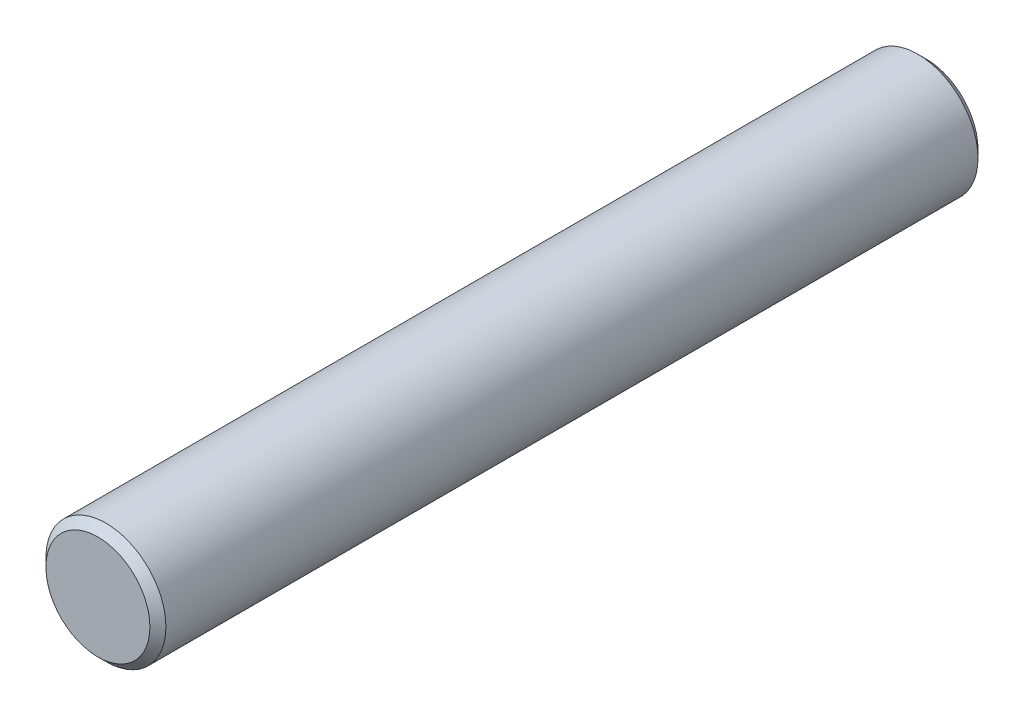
ISO-10303-21;
HEADER;
FILE_DESCRIPTION(('STEP AP214'),'2;1');
FILE_NAME('part.step','',(''),(''),'','','');
FILE_SCHEMA(('AUTOMOTIVE_DESIGN { 1 0 10303 214 1 1 1 1 }'));
ENDSEC;
DATA;
#1=APPLICATION_CONTEXT('core data for automotive mechanical design processes');
#2=APPLICATION_PROTOCOL_DEFINITION('international standard','automotive_design',2000,#1);
#3=PRODUCT_CONTEXT('',#1,'mechanical');
#4=PRODUCT('Part','Part','',(#3));
#5=PRODUCT_RELATED_PRODUCT_CATEGORY('part','',(#4));
#6=PRODUCT_DEFINITION_FORMATION('','',#4);
#7=PRODUCT_DEFINITION_CONTEXT('part definition',#1,'design');
#8=PRODUCT_DEFINITION('design','',#6,#7);
#9=PRODUCT_DEFINITION_SHAPE('','',#8);
#10=(LENGTH_UNIT() NAMED_UNIT(*) SI_UNIT(.MILLI.,.METRE.));
#11=(NAMED_UNIT(*) PLANE_ANGLE_UNIT() SI_UNIT($,.RADIAN.));
#12=(NAMED_UNIT(*) SI_UNIT($,.STERADIAN.) SOLID_ANGLE_UNIT());
#13=UNCERTAINTY_MEASURE_WITH_UNIT(LENGTH_MEASURE(1.E-05),#10,'distance_accuracy_value','');
#14=(GEOMETRIC_REPRESENTATION_CONTEXT(3) GLOBAL_UNCERTAINTY_ASSIGNED_CONTEXT((#13)) GLOBAL_UNIT_ASSIGNED_CONTEXT((#10,
#11,#12)) REPRESENTATION_CONTEXT('',''));
#15=CARTESIAN_POINT('',(0.,0.,0.));
#16=DIRECTION('',(0.,0.,1.));
#17=DIRECTION('',(1.,0.,0.));
#18=AXIS2_PLACEMENT_3D('',#15,#16,#17);
#19=CARTESIAN_POINT('',(0.,0.,20.7));
#20=DIRECTION('',(0.,0.,-1.));
#21=DIRECTION('',(-1.,0.,0.));
#22=AXIS2_PLACEMENT_3D('',#19,#20,#21);
#23=CYLINDRICAL_SURFACE('',#22,1.5);
#24=CARTESIAN_POINT('',(0.,0.,0.199999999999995));
#25=DIRECTION('',(0.,0.,1.));
#26=DIRECTION('',(1.,0.,0.));
#27=AXIS2_PLACEMENT_3D('',#24,#25,#26);
#28=CIRCLE('',#27,1.5);
#29=CARTESIAN_POINT('',(1.5,0.,0.199999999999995));
#30=VERTEX_POINT('',#29);
#31=EDGE_CURVE('E42',#30,#30,#28,.T.);
#32=ORIENTED_EDGE('',*,*,#31,.T.);
#33=EDGE_LOOP('',(#32));
#34=FACE_BOUND('',#33,.T.);
#35=CARTESIAN_POINT('',(0.,0.,20.5));
#36=DIRECTION('',(0.,0.,1.));
#37=DIRECTION('',(1.,0.,0.));
#38=AXIS2_PLACEMENT_3D('',#35,#36,#37);
#39=CIRCLE('',#38,1.5);
#40=CARTESIAN_POINT('',(1.5,0.,20.5));
#41=VERTEX_POINT('',#40);
#42=EDGE_CURVE('E46',#41,#41,#39,.F.);
#43=ORIENTED_EDGE('',*,*,#42,.T.);
#44=EDGE_LOOP('',(#43));
#45=FACE_BOUND('',#44,.T.);
#46=ADVANCED_FACE('F32',(#34,#45),#23,.T.);
#47=CARTESIAN_POINT('',(0.,0.,20.7));
#48=DIRECTION('',(0.,0.,1.));
#49=DIRECTION('',(1.,0.,0.));
#50=AXIS2_PLACEMENT_3D('',#47,#48,#49);
#51=PLANE('',#50);
#52=CARTESIAN_POINT('',(0.,0.,20.7));
#53=DIRECTION('',(0.,0.,1.));
#54=DIRECTION('',(1.,0.,0.));
#55=AXIS2_PLACEMENT_3D('',#52,#53,#54);
#56=CIRCLE('',#55,1.3);
#57=CARTESIAN_POINT('',(1.3,0.,20.7));
#58=VERTEX_POINT('',#57);
#59=EDGE_CURVE('E10',#58,#58,#56,.T.);
#60=ORIENTED_EDGE('',*,*,#59,.T.);
#61=EDGE_LOOP('',(#60));
#62=FACE_BOUND('',#61,.T.);
#63=ADVANCED_FACE('F65',(#62),#51,.T.);
#64=CARTESIAN_POINT('',(0.,0.,0.));
#65=DIRECTION('',(0.,0.,1.));
#66=DIRECTION('',(1.,0.,0.));
#67=AXIS2_PLACEMENT_3D('',#64,#65,#66);
#68=PLANE('',#67);
#69=CARTESIAN_POINT('',(0.,0.,0.));
#70=DIRECTION('',(0.,0.,1.));
#71=DIRECTION('',(1.,0.,0.));
#72=AXIS2_PLACEMENT_3D('',#69,#70,#71);
#73=CIRCLE('',#72,1.30000000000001);
#74=CARTESIAN_POINT('',(1.30000000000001,0.,0.));
#75=VERTEX_POINT('',#74);
#76=EDGE_CURVE('E38',#75,#75,#73,.F.);
#77=ORIENTED_EDGE('',*,*,#76,.T.);
#78=EDGE_LOOP('',(#77));
#79=FACE_BOUND('',#78,.T.);
#80=ADVANCED_FACE('F61',(#79),#68,.F.);
#81=CARTESIAN_POINT('',(0.,0.,0.199999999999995));
#82=DIRECTION('',(0.,0.,1.));
#83=DIRECTION('',(1.,0.,0.));
#84=AXIS2_PLACEMENT_3D('',#81,#82,#83);
#85=CONICAL_SURFACE('',#84,1.5,0.785398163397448);
#86=ORIENTED_EDGE('',*,*,#76,.F.);
#87=EDGE_LOOP('',(#86));
#88=FACE_BOUND('',#87,.T.);
#89=ORIENTED_EDGE('',*,*,#31,.F.);
#90=EDGE_LOOP('',(#89));
#91=FACE_BOUND('',#90,.T.);
#92=ADVANCED_FACE('F56',(#88,#91),#85,.T.);
#93=CARTESIAN_POINT('',(0.,0.,20.7));
#94=DIRECTION('',(0.,0.,-1.));
#95=DIRECTION('',(-1.,0.,0.));
#96=AXIS2_PLACEMENT_3D('',#93,#94,#95);
#97=CONICAL_SURFACE('',#96,1.3,0.78539816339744);
#98=ORIENTED_EDGE('',*,*,#42,.F.);
#99=EDGE_LOOP('',(#98));
#100=FACE_BOUND('',#99,.T.);
#101=ORIENTED_EDGE('',*,*,#59,.F.);
#102=EDGE_LOOP('',(#101));
#103=FACE_BOUND('',#102,.T.);
#104=ADVANCED_FACE('F53',(#100,#103),#97,.T.);
#105=CLOSED_SHELL('',(#46,#63,#80,#92,#104));
#106=MANIFOLD_SOLID_BREP('B2',#105);
#107=ADVANCED_BREP_SHAPE_REPRESENTATION('',(#18,#106),#14);
#108=SHAPE_DEFINITION_REPRESENTATION(#9,#107);
ENDSEC;
END-ISO-10303-21;
